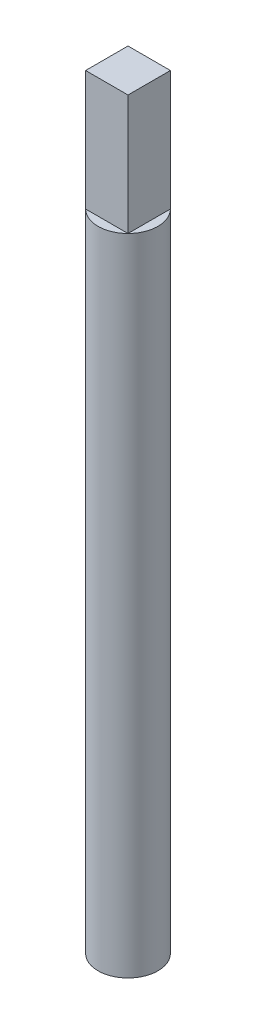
from build123d import *

# Parameters (mm, degrees)
SKETCH1_R           = 2.5
BOSS_EXTRUDE1_DEPTH = 63.75
SKETCH2_W           = 1
SKETCH2_H           = 3
CUT_EXTRUDE2_DEPTH  = 1
CUT_EXTRUDE3_START  = -10
CUT_EXTRUDE3_DEPTH  = 10


with BuildPart() as part:
    # Sketch1 → Boss-Extrude1 (new body)
    with BuildSketch(Plane(origin=(0, 0, 0), x_dir=(1, 0, 0), z_dir=(0, 1, 0))):
        with Locations(Location((2.5, 0, 0), (0, 0, 270))):
            Circle(SKETCH1_R)
    extrude(amount=BOSS_EXTRUDE1_DEPTH)

    # Sketch2 → Cut-Extrude2 (cut)
    with BuildSketch(Plane(origin=(0, 0, 0), x_dir=(0, 0, -1), z_dir=(1, 0, 0))):
        with Locations((0, 1.5)):
            Rectangle(SKETCH2_W, SKETCH2_H)
    extrude(amount=CUT_EXTRUDE2_DEPTH, mode=Mode.SUBTRACT)

    # Sketch3 → Cut-Extrude3 (cut)
    with BuildSketch(Plane(origin=(0, 63.75, 0), x_dir=(1, 0, 0), z_dir=(0, 1, 0)).offset(CUT_EXTRUDE3_START)):
        with BuildLine():
            ThreePointArc((4.267766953, 1.767766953), (2.5, 2.5), (0.732233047, 1.767766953))
            Line((0.732233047, 1.767766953), (4.267766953, 1.767766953))
        make_face()
        with BuildLine():
            Line((0.732233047, -1.767766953), (0.732233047, 1.767766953))
            ThreePointArc((0.732233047, 1.767766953), (0, 0), (0.732233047, -1.767766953))
        make_face()
        with BuildLine():
            ThreePointArc((4.267766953, -1.767766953), (5, 0), (4.267766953, 1.767766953))
            Line((4.267766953, 1.767766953), (4.267766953, -1.767766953))
        make_face()
        with BuildLine():
            Line((4.267766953, -1.767766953), (0.732233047, -1.767766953))
            ThreePointArc((0.732233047, -1.767766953), (2.5, -2.5), (4.267766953, -1.767766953))
        make_face()
    extrude(amount=CUT_EXTRUDE3_DEPTH, mode=Mode.SUBTRACT)


solid = part.part
